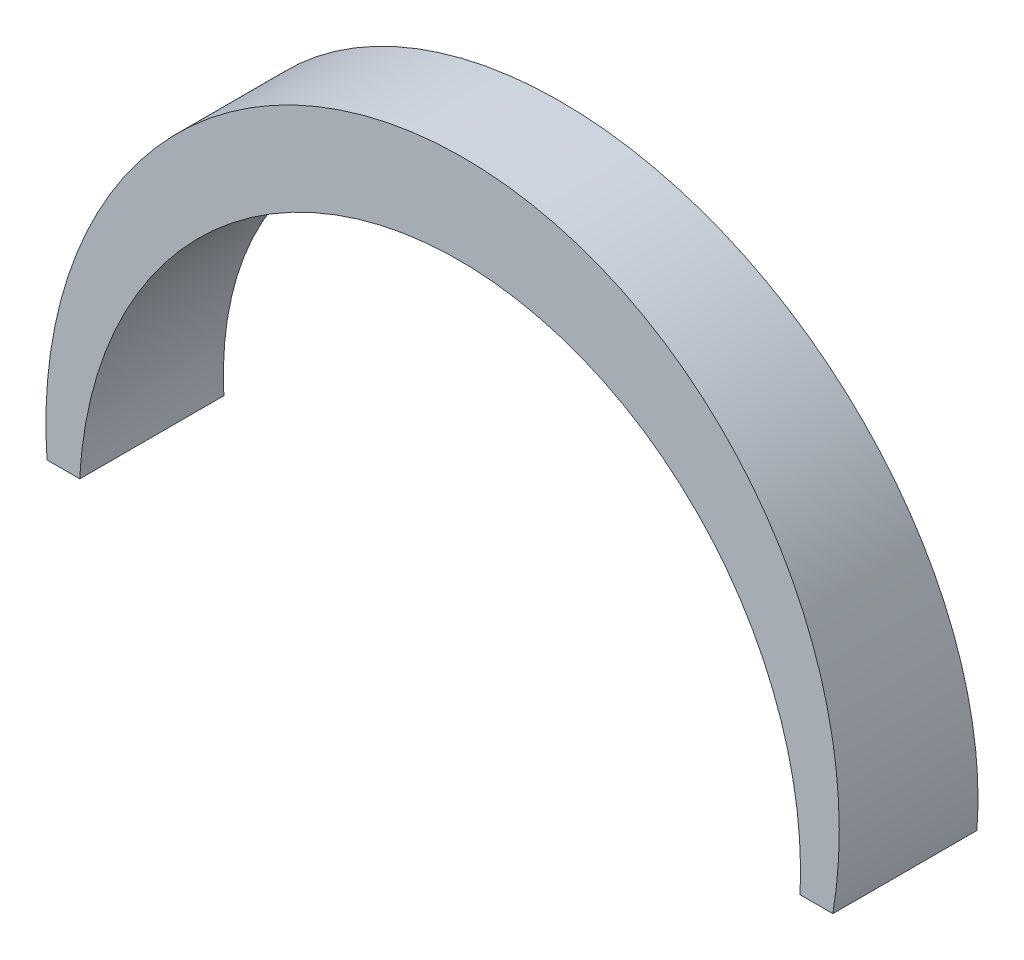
ISO-10303-21;
HEADER;
FILE_DESCRIPTION(('STEP AP214'),'2;1');
FILE_NAME('part.step','',(''),(''),'','','');
FILE_SCHEMA(('AUTOMOTIVE_DESIGN { 1 0 10303 214 1 1 1 1 }'));
ENDSEC;
DATA;
#1=APPLICATION_CONTEXT('core data for automotive mechanical design processes');
#2=APPLICATION_PROTOCOL_DEFINITION('international standard','automotive_design',2000,#1);
#3=PRODUCT_CONTEXT('',#1,'mechanical');
#4=PRODUCT('Part','Part','',(#3));
#5=PRODUCT_RELATED_PRODUCT_CATEGORY('part','',(#4));
#6=PRODUCT_DEFINITION_FORMATION('','',#4);
#7=PRODUCT_DEFINITION_CONTEXT('part definition',#1,'design');
#8=PRODUCT_DEFINITION('design','',#6,#7);
#9=PRODUCT_DEFINITION_SHAPE('','',#8);
#10=(LENGTH_UNIT() NAMED_UNIT(*) SI_UNIT(.MILLI.,.METRE.));
#11=(NAMED_UNIT(*) PLANE_ANGLE_UNIT() SI_UNIT($,.RADIAN.));
#12=(NAMED_UNIT(*) SI_UNIT($,.STERADIAN.) SOLID_ANGLE_UNIT());
#13=UNCERTAINTY_MEASURE_WITH_UNIT(LENGTH_MEASURE(1.E-05),#10,'distance_accuracy_value','');
#14=(GEOMETRIC_REPRESENTATION_CONTEXT(3) GLOBAL_UNCERTAINTY_ASSIGNED_CONTEXT((#13)) GLOBAL_UNIT_ASSIGNED_CONTEXT((#10,
#11,#12)) REPRESENTATION_CONTEXT('',''));
#15=CARTESIAN_POINT('',(0.,0.,0.));
#16=DIRECTION('',(0.,0.,1.));
#17=DIRECTION('',(1.,0.,0.));
#18=AXIS2_PLACEMENT_3D('',#15,#16,#17);
#19=CARTESIAN_POINT('',(0.,0.,10.));
#20=DIRECTION('',(0.,0.,-1.));
#21=DIRECTION('',(-1.,0.,0.));
#22=AXIS2_PLACEMENT_3D('',#19,#20,#21);
#23=CYLINDRICAL_SURFACE('',#22,50.);
#24=DIRECTION('',(0.,0.,-1.));
#25=VECTOR('',#24,1.);
#26=CARTESIAN_POINT('',(-50.,0.,10.));
#27=LINE('',#26,#25);
#28=CARTESIAN_POINT('',(-49.9999999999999,0.,10.));
#29=VERTEX_POINT('',#28);
#30=CARTESIAN_POINT('',(-50.,0.,-10.));
#31=VERTEX_POINT('',#30);
#32=EDGE_CURVE('E99',#29,#31,#27,.T.);
#33=ORIENTED_EDGE('',*,*,#32,.T.);
#34=CARTESIAN_POINT('',(0.,0.,-10.));
#35=DIRECTION('',(0.,-0.0523359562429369,0.998629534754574));
#36=DIRECTION('',(0.,-0.998629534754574,-0.0523359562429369));
#37=AXIS2_PLACEMENT_3D('',#34,#35,#36);
#38=ELLIPSE('',#37,50.068617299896,50.);
#39=CARTESIAN_POINT('',(50.,0.,-10.));
#40=VERTEX_POINT('',#39);
#41=EDGE_CURVE('E79',#31,#40,#38,.F.);
#42=ORIENTED_EDGE('',*,*,#41,.T.);
#43=DIRECTION('',(0.,0.,-1.));
#44=VECTOR('',#43,1.);
#45=CARTESIAN_POINT('',(50.,0.,10.));
#46=LINE('',#45,#44);
#47=CARTESIAN_POINT('',(50.,0.,10.));
#48=VERTEX_POINT('',#47);
#49=EDGE_CURVE('E11',#48,#40,#46,.T.);
#50=ORIENTED_EDGE('',*,*,#49,.F.);
#51=CARTESIAN_POINT('',(0.,0.,10.));
#52=DIRECTION('',(0.,0.0523359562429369,0.998629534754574));
#53=DIRECTION('',(0.,0.998629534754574,-0.0523359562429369));
#54=AXIS2_PLACEMENT_3D('',#51,#52,#53);
#55=ELLIPSE('',#54,50.068617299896,50.);
#56=EDGE_CURVE('E87',#29,#48,#55,.F.);
#57=ORIENTED_EDGE('',*,*,#56,.F.);
#58=EDGE_LOOP('',(#33,#42,#50,#57));
#59=FACE_BOUND('',#58,.T.);
#60=ADVANCED_FACE('F33',(#59),#23,.F.);
#61=CARTESIAN_POINT('',(0.,7.,10.));
#62=DIRECTION('',(0.,0.,-1.));
#63=DIRECTION('',(-1.,0.,0.));
#64=AXIS2_PLACEMENT_3D('',#61,#62,#63);
#65=CYLINDRICAL_SURFACE('',#64,55.);
#66=DIRECTION('',(0.,0.,-1.));
#67=VECTOR('',#66,1.);
#68=CARTESIAN_POINT('',(54.5527267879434,0.,10.));
#69=LINE('',#68,#67);
#70=CARTESIAN_POINT('',(54.5527267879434,0.,10.));
#71=VERTEX_POINT('',#70);
#72=CARTESIAN_POINT('',(54.5527267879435,0.,-10.));
#73=VERTEX_POINT('',#72);
#74=EDGE_CURVE('E40',#71,#73,#69,.T.);
#75=ORIENTED_EDGE('',*,*,#74,.T.);
#76=CARTESIAN_POINT('',(0.,7.,-9.63314554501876));
#77=DIRECTION('',(0.,-0.0523359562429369,0.998629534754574));
#78=DIRECTION('',(0.,-0.998629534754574,-0.0523359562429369));
#79=AXIS2_PLACEMENT_3D('',#76,#77,#78);
#80=ELLIPSE('',#79,55.0754790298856,55.);
#81=CARTESIAN_POINT('',(-54.5527267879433,0.,-10.));
#82=VERTEX_POINT('',#81);
#83=EDGE_CURVE('E72',#73,#82,#80,.T.);
#84=ORIENTED_EDGE('',*,*,#83,.T.);
#85=DIRECTION('',(0.,0.,-1.));
#86=VECTOR('',#85,1.);
#87=CARTESIAN_POINT('',(-54.5527267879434,0.,10.));
#88=LINE('',#87,#86);
#89=CARTESIAN_POINT('',(-54.5527267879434,0.,10.));
#90=VERTEX_POINT('',#89);
#91=EDGE_CURVE('E47',#90,#82,#88,.T.);
#92=ORIENTED_EDGE('',*,*,#91,.F.);
#93=CARTESIAN_POINT('',(0.,7.,9.63314554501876));
#94=DIRECTION('',(0.,0.0523359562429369,0.998629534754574));
#95=DIRECTION('',(0.,0.998629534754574,-0.0523359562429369));
#96=AXIS2_PLACEMENT_3D('',#93,#94,#95);
#97=ELLIPSE('',#96,55.0754790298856,55.);
#98=EDGE_CURVE('E52',#71,#90,#97,.T.);
#99=ORIENTED_EDGE('',*,*,#98,.F.);
#100=EDGE_LOOP('',(#75,#84,#92,#99));
#101=FACE_BOUND('',#100,.T.);
#102=ADVANCED_FACE('F81',(#101),#65,.T.);
#103=CARTESIAN_POINT('',(50.,0.,10.));
#104=DIRECTION('',(0.,1.,0.));
#105=DIRECTION('',(0.,0.,1.));
#106=AXIS2_PLACEMENT_3D('',#103,#104,#105);
#107=PLANE('',#106);
#108=ORIENTED_EDGE('',*,*,#49,.T.);
#109=DIRECTION('',(1.,0.,0.));
#110=VECTOR('',#109,1.);
#111=CARTESIAN_POINT('',(50.,0.,-10.));
#112=LINE('',#111,#110);
#113=EDGE_CURVE('E75',#40,#73,#112,.T.);
#114=ORIENTED_EDGE('',*,*,#113,.T.);
#115=ORIENTED_EDGE('',*,*,#74,.F.);
#116=DIRECTION('',(1.,0.,0.));
#117=VECTOR('',#116,1.);
#118=CARTESIAN_POINT('',(50.,0.,10.));
#119=LINE('',#118,#117);
#120=EDGE_CURVE('E94',#48,#71,#119,.T.);
#121=ORIENTED_EDGE('',*,*,#120,.F.);
#122=EDGE_LOOP('',(#108,#114,#115,#121));
#123=FACE_BOUND('',#122,.T.);
#124=ADVANCED_FACE('F84',(#123),#107,.F.);
#125=CARTESIAN_POINT('',(-54.5527267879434,0.,10.));
#126=DIRECTION('',(0.,1.,0.));
#127=DIRECTION('',(0.,0.,1.));
#128=AXIS2_PLACEMENT_3D('',#125,#126,#127);
#129=PLANE('',#128);
#130=ORIENTED_EDGE('',*,*,#91,.T.);
#131=DIRECTION('',(1.,0.,0.));
#132=VECTOR('',#131,1.);
#133=CARTESIAN_POINT('',(-54.5527267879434,0.,-10.));
#134=LINE('',#133,#132);
#135=EDGE_CURVE('E78',#82,#31,#134,.T.);
#136=ORIENTED_EDGE('',*,*,#135,.T.);
#137=ORIENTED_EDGE('',*,*,#32,.F.);
#138=DIRECTION('',(1.,0.,0.));
#139=VECTOR('',#138,1.);
#140=CARTESIAN_POINT('',(-54.5527267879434,0.,10.));
#141=LINE('',#140,#139);
#142=EDGE_CURVE('E96',#90,#29,#141,.T.);
#143=ORIENTED_EDGE('',*,*,#142,.F.);
#144=EDGE_LOOP('',(#130,#136,#137,#143));
#145=FACE_BOUND('',#144,.T.);
#146=ADVANCED_FACE('F103',(#145),#129,.F.);
#147=CARTESIAN_POINT('',(220.83114033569,0.,10.));
#148=DIRECTION('',(0.,0.0523359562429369,0.998629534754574));
#149=DIRECTION('',(0.,-0.998629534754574,0.0523359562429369));
#150=AXIS2_PLACEMENT_3D('',#147,#148,#149);
#151=PLANE('',#150);
#152=ORIENTED_EDGE('',*,*,#142,.T.);
#153=ORIENTED_EDGE('',*,*,#56,.T.);
#154=ORIENTED_EDGE('',*,*,#120,.T.);
#155=ORIENTED_EDGE('',*,*,#98,.T.);
#156=EDGE_LOOP('',(#152,#153,#154,#155));
#157=FACE_BOUND('',#156,.T.);
#158=ADVANCED_FACE('F106',(#157),#151,.T.);
#159=CARTESIAN_POINT('',(222.304568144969,0.,-10.));
#160=DIRECTION('',(0.,-0.0523359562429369,0.998629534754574));
#161=DIRECTION('',(0.,-0.998629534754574,-0.0523359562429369));
#162=AXIS2_PLACEMENT_3D('',#159,#160,#161);
#163=PLANE('',#162);
#164=ORIENTED_EDGE('',*,*,#41,.F.);
#165=ORIENTED_EDGE('',*,*,#135,.F.);
#166=ORIENTED_EDGE('',*,*,#83,.F.);
#167=ORIENTED_EDGE('',*,*,#113,.F.);
#168=EDGE_LOOP('',(#164,#165,#166,#167));
#169=FACE_BOUND('',#168,.T.);
#170=ADVANCED_FACE('F73',(#169),#163,.F.);
#171=CLOSED_SHELL('',(#60,#102,#124,#146,#158,#170));
#172=MANIFOLD_SOLID_BREP('B2',#171);
#173=ADVANCED_BREP_SHAPE_REPRESENTATION('',(#18,#172),#14);
#174=SHAPE_DEFINITION_REPRESENTATION(#9,#173);
ENDSEC;
END-ISO-10303-21;
